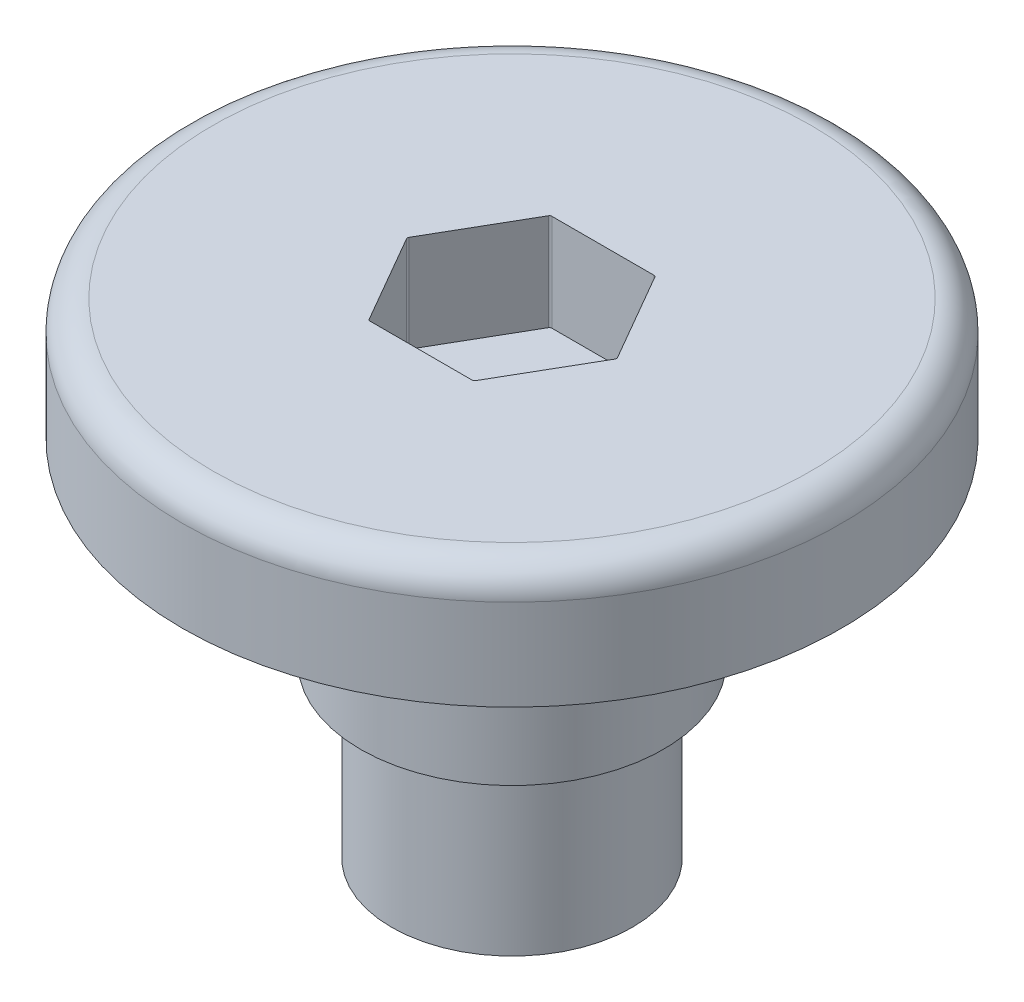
from build123d import *

# Parameters (mm, degrees)
CUT_EXTRUDE1_DEPTH = 5.08
FILLET1_R          = 1.5875
FILLET2_R          = 0.127


with BuildPart() as part:
    # Sketch1 → Revolve1 (revolve)
    with BuildSketch(Plane.XY, mode=Mode.PRIVATE) as revolve1_sk:
        with BuildLine():
            Line((0, 0), (-6.3119, 0))
            Line((-6.3119, 0), (-6.3119, 8.89))
            Line((-6.3119, 8.89), (-7.9375, 8.89))
            Line((-7.9375, 8.89), (-7.9375, 13.2715))
            ThreePointArc((-7.9375, 13.2715), (-7.900302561, 13.361302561), (-7.8105, 13.3985))
            Line((-7.8105, 13.3985), (-6.1341, 13.3985))
            ThreePointArc((-6.1341, 13.3985), (-5.954494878, 13.472894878), (-5.8801, 13.6525))
            Line((-5.8801, 13.6525), (-5.8801, 16.764))
            ThreePointArc((-5.8801, 16.764), (-5.954494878, 16.943605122), (-6.1341, 17.018))
            Line((-6.1341, 17.018), (-7.8105, 17.018))
            ThreePointArc((-7.8105, 17.018), (-7.900302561, 17.055197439), (-7.9375, 17.145))
            Line((-7.9375, 17.145), (-7.9375, 19.05))
            Line((-7.9375, 19.05), (-9.9822, 19.05))
            ThreePointArc((-9.9822, 19.05), (-10.072002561, 19.087197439), (-10.1092, 19.177))
            Line((-10.1092, 19.177), (-10.1092, 21.2471))
            ThreePointArc((-10.1092, 21.2471), (-10.239391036, 21.561408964), (-10.5537, 21.6916))
            Line((-10.5537, 21.6916), (-14.2875, 21.6916))
            ThreePointArc((-14.2875, 21.6916), (-14.601808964, 21.561408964), (-14.732, 21.2471))
            Line((-14.732, 21.2471), (-14.732, 19.177))
            ThreePointArc((-14.732, 19.177), (-14.769197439, 19.087197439), (-14.859, 19.05))
            Line((-14.859, 19.05), (-17.272, 19.05))
            Line((-17.272, 19.05), (-17.272, 25.4))
            Line((-17.272, 25.4), (0, 25.4))
            Line((0, 25.4), (0, 0))
        make_face()
    revolve(revolve1_sk.sketch.rotate(Axis((0, 0, 0), (0, 1, 0)), 270), axis=Axis((0, 0, 0), (0, 1, 0)))

    # Sketch3 → Cut-Extrude1 (cut)
    with BuildSketch(Plane(origin=(0, 25.4, 0), x_dir=(1, 0, 0), z_dir=(0, 1, 0))):
        Polygon((2.749630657, 4.7625), (-2.749630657, 4.7625), (-5.499261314, 0), (-2.749630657, -4.7625), (2.749630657, -4.7625), (5.499261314, 0), align=None)
    extrude(amount=-CUT_EXTRUDE1_DEPTH, mode=Mode.SUBTRACT)

    # Fillet1
    fillet1_edges = [part.edges().sort_by_distance(p)[0] for p in [
        (0, 25.4, 17.272),
    ]]
    fillet(fillet1_edges, radius=FILLET1_R)

    # Fillet2
    fillet2_edges = [part.edges().sort_by_distance(p)[0] for p in [
        (2.749630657, 22.86, -4.7625),
        (5.499261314, 22.86, 0),
        (2.749630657, 22.86, 4.7625),
        (-2.749630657, 22.86, 4.7625),
        (-5.499261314, 22.86, 0),
        (-2.749630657, 22.86, -4.7625),
    ]]
    fillet(fillet2_edges, radius=FILLET2_R)


solid = part.part
